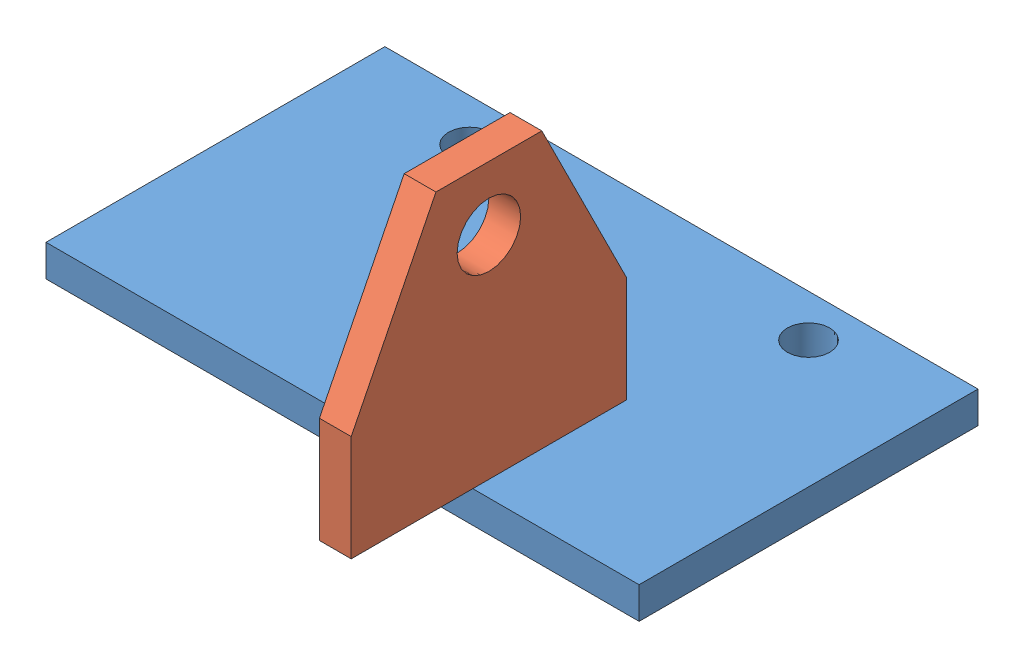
SolidWorks assembly Width Mates 2.SLDASM, configuration Default (file format 3042). Lengths in mm.
Overall size (177.8 92.08 138.05).
2 component instances, 2 part files, 2 mates.
Components (placement in the parent):
- RectBase-1: RectBase.SLDPRT [Default] at (-0.1949 -4.614 0.0019) size (177.8 9.53 101.6)
- EndConnect-1: EndConnect.SLDPRT [Default] at (38.8493 4.911 45.975) x (0 0 1) z (-1 0 0) size (82.55 82.55 9.53)
Mates (geometry in assembly coordinates):
- Distance1: distance = 49.8558 mm: 
- Coincident2: coincident anti-aligned: 
